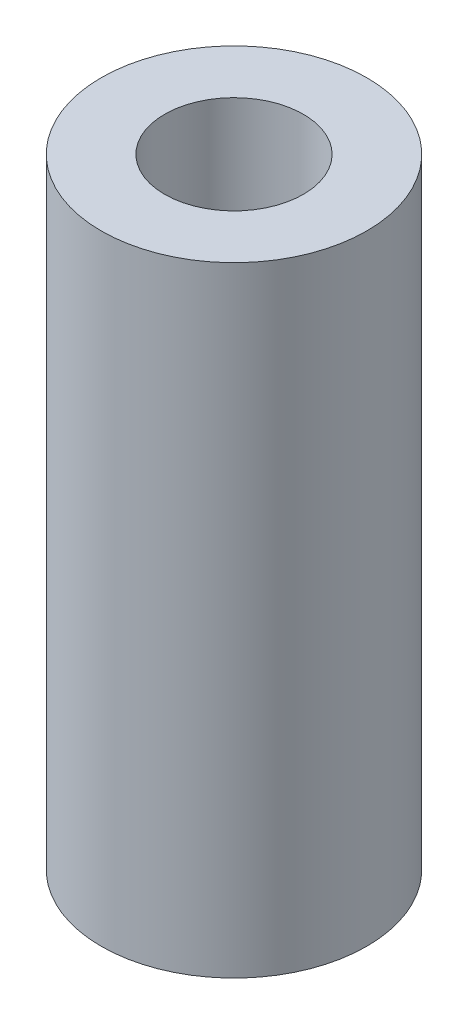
from build123d import *

# Parameters (mm, degrees)
SKETCH1_R           = 4.7625
SKETCH1_R_2         = 2.4892
BOSS_EXTRUDE1_DEPTH = 22.225


with BuildPart() as part:
    # Sketch1 → Boss-Extrude1 (new body)
    with BuildSketch(Plane(origin=(0, 0, 0), x_dir=(1, 0, 0), z_dir=(0, 1, 0))):
        with Locations(Location((0, 0, 0), (0, 0, 270))):
            Circle(SKETCH1_R)
        with Locations(Location((0, 0, 0), (0, 0, 270))):
            Circle(SKETCH1_R_2, mode=Mode.SUBTRACT)
    extrude(amount=BOSS_EXTRUDE1_DEPTH)


solid = part.part
